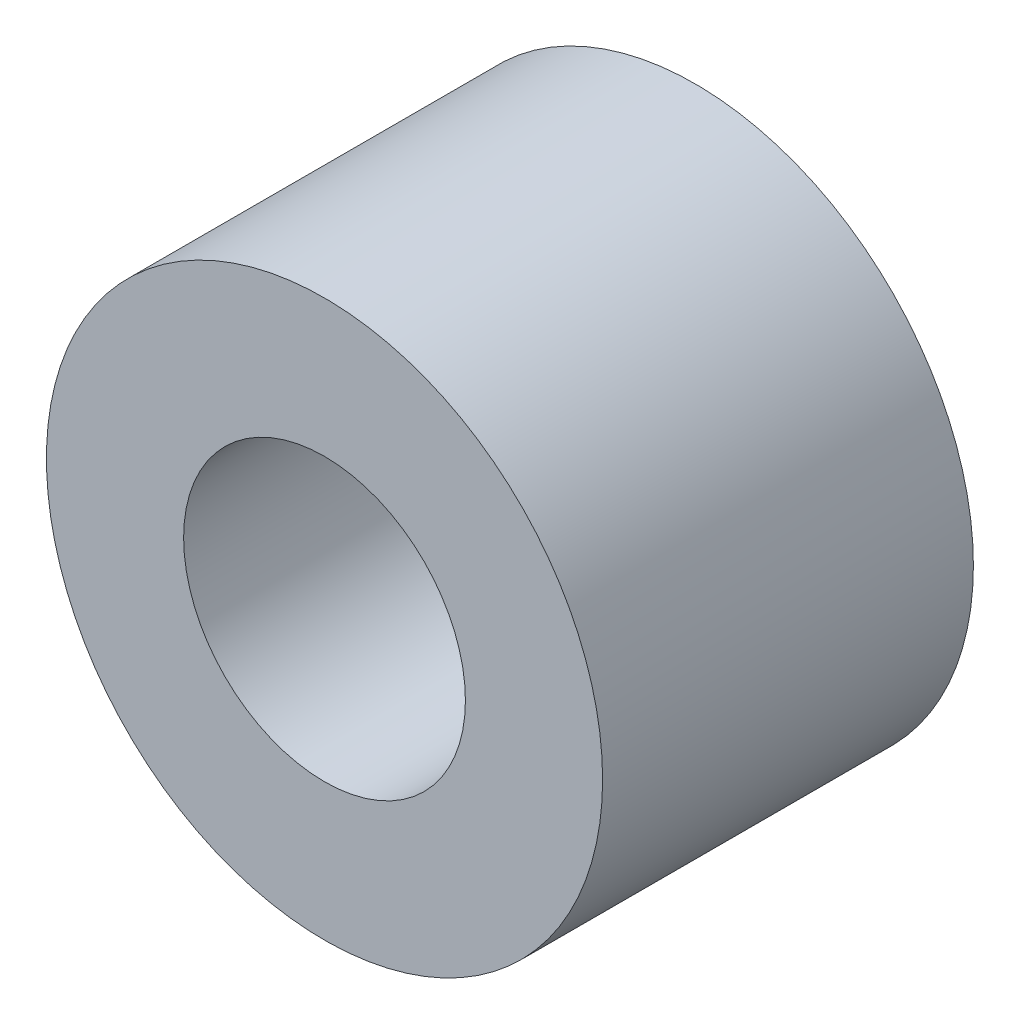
from build123d import *

# Parameters (mm, degrees)
EXTRUDE1_DEPTH      = 6.35
EXTRUDE1_DEPTH_BACK = 6.35
SKETCH1_R           = 9.525
SKETCH1_R_2         = 4.826


with BuildPart() as part:
    # Sketch1 → Extrude1 (new, two sides: drawn at the far end of the back side and taken through both)
    with BuildSketch(Plane.XY.offset(-EXTRUDE1_DEPTH_BACK)):
        Circle(SKETCH1_R)
        Circle(SKETCH1_R_2, mode=Mode.SUBTRACT)
    extrude(amount=EXTRUDE1_DEPTH + EXTRUDE1_DEPTH_BACK)


solid = part.part
